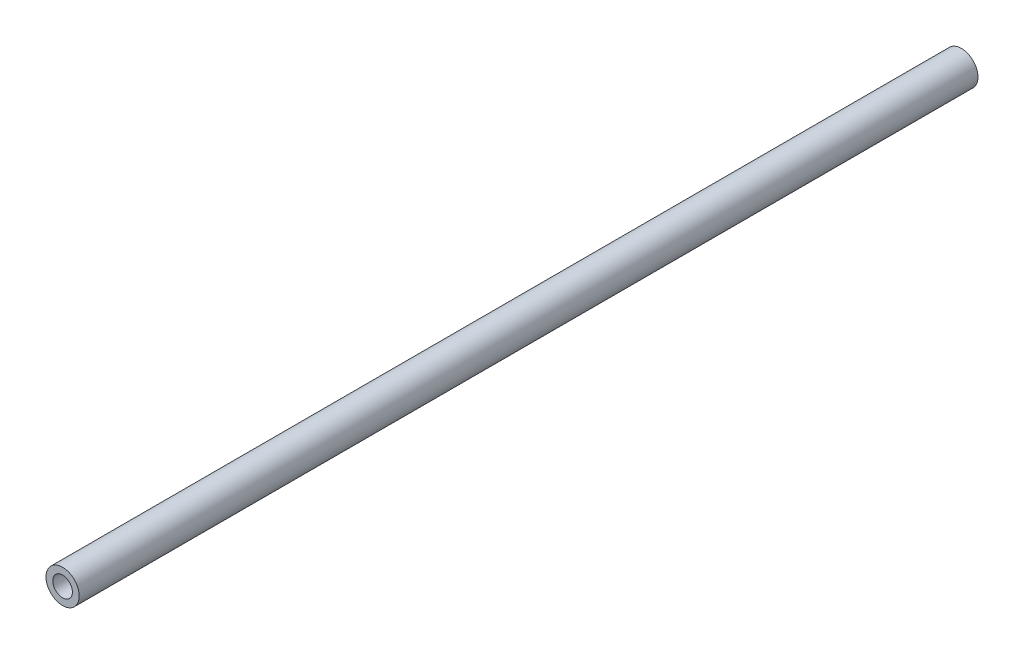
ISO-10303-21;
HEADER;
FILE_DESCRIPTION(('STEP AP214'),'2;1');
FILE_NAME('part.step','',(''),(''),'','','');
FILE_SCHEMA(('AUTOMOTIVE_DESIGN { 1 0 10303 214 1 1 1 1 }'));
ENDSEC;
DATA;
#1=APPLICATION_CONTEXT('core data for automotive mechanical design processes');
#2=APPLICATION_PROTOCOL_DEFINITION('international standard','automotive_design',2000,#1);
#3=PRODUCT_CONTEXT('',#1,'mechanical');
#4=PRODUCT('Part','Part','',(#3));
#5=PRODUCT_RELATED_PRODUCT_CATEGORY('part','',(#4));
#6=PRODUCT_DEFINITION_FORMATION('','',#4);
#7=PRODUCT_DEFINITION_CONTEXT('part definition',#1,'design');
#8=PRODUCT_DEFINITION('design','',#6,#7);
#9=PRODUCT_DEFINITION_SHAPE('','',#8);
#10=(LENGTH_UNIT() NAMED_UNIT(*) SI_UNIT(.MILLI.,.METRE.));
#11=(NAMED_UNIT(*) PLANE_ANGLE_UNIT() SI_UNIT($,.RADIAN.));
#12=(NAMED_UNIT(*) SI_UNIT($,.STERADIAN.) SOLID_ANGLE_UNIT());
#13=UNCERTAINTY_MEASURE_WITH_UNIT(LENGTH_MEASURE(1.E-05),#10,'distance_accuracy_value','');
#14=(GEOMETRIC_REPRESENTATION_CONTEXT(3) GLOBAL_UNCERTAINTY_ASSIGNED_CONTEXT((#13)) GLOBAL_UNIT_ASSIGNED_CONTEXT((#10,
#11,#12)) REPRESENTATION_CONTEXT('',''));
#15=CARTESIAN_POINT('',(0.,0.,0.));
#16=DIRECTION('',(0.,0.,1.));
#17=DIRECTION('',(1.,0.,0.));
#18=AXIS2_PLACEMENT_3D('',#15,#16,#17);
#19=CARTESIAN_POINT('',(0.,0.,-730.));
#20=DIRECTION('',(0.,0.,1.));
#21=DIRECTION('',(1.,0.,0.));
#22=AXIS2_PLACEMENT_3D('',#19,#20,#21);
#23=CYLINDRICAL_SURFACE('',#22,13.5);
#24=CARTESIAN_POINT('',(0.,0.,-730.));
#25=DIRECTION('',(0.,0.,1.));
#26=DIRECTION('',(1.,0.,0.));
#27=AXIS2_PLACEMENT_3D('',#24,#25,#26);
#28=CIRCLE('',#27,13.5);
#29=CARTESIAN_POINT('',(13.5,0.,-730.));
#30=VERTEX_POINT('',#29);
#31=EDGE_CURVE('E10',#30,#30,#28,.T.);
#32=CARTESIAN_POINT('',(0.,0.,0.));
#33=DIRECTION('',(0.,0.,1.));
#34=DIRECTION('',(1.,0.,0.));
#35=AXIS2_PLACEMENT_3D('',#32,#33,#34);
#36=CIRCLE('',#35,13.5);
#37=CARTESIAN_POINT('',(13.5,0.,-1.11022302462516E-13));
#38=VERTEX_POINT('',#37);
#39=EDGE_CURVE('E33',#38,#38,#36,.T.);
#40=CARTESIAN_POINT('',(13.5,0.,-730.));
#41=CARTESIAN_POINT('',(13.5,0.,-722.395833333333));
#42=CARTESIAN_POINT('',(13.5,0.,-714.791666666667));
#43=CARTESIAN_POINT('',(13.5,0.,-699.583333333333));
#44=CARTESIAN_POINT('',(13.5,0.,-691.979166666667));
#45=CARTESIAN_POINT('',(13.5,0.,-676.770833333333));
#46=CARTESIAN_POINT('',(13.5,0.,-669.166666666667));
#47=CARTESIAN_POINT('',(13.5,0.,-653.958333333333));
#48=CARTESIAN_POINT('',(13.5,0.,-646.354166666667));
#49=CARTESIAN_POINT('',(13.5,0.,-631.145833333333));
#50=CARTESIAN_POINT('',(13.5,0.,-623.541666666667));
#51=CARTESIAN_POINT('',(13.5,0.,-608.333333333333));
#52=CARTESIAN_POINT('',(13.5,0.,-600.729166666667));
#53=CARTESIAN_POINT('',(13.5,0.,-585.520833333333));
#54=CARTESIAN_POINT('',(13.5,0.,-577.916666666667));
#55=CARTESIAN_POINT('',(13.5,0.,-562.708333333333));
#56=CARTESIAN_POINT('',(13.5,0.,-555.104166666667));
#57=CARTESIAN_POINT('',(13.5,0.,-539.895833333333));
#58=CARTESIAN_POINT('',(13.5,0.,-532.291666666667));
#59=CARTESIAN_POINT('',(13.5,0.,-517.083333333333));
#60=CARTESIAN_POINT('',(13.5,0.,-509.479166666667));
#61=CARTESIAN_POINT('',(13.5,0.,-494.270833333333));
#62=CARTESIAN_POINT('',(13.5,0.,-486.666666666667));
#63=CARTESIAN_POINT('',(13.5,0.,-471.458333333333));
#64=CARTESIAN_POINT('',(13.5,0.,-463.854166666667));
#65=CARTESIAN_POINT('',(13.5,0.,-448.645833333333));
#66=CARTESIAN_POINT('',(13.5,0.,-441.041666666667));
#67=CARTESIAN_POINT('',(13.5,0.,-425.833333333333));
#68=CARTESIAN_POINT('',(13.5,0.,-418.229166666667));
#69=CARTESIAN_POINT('',(13.5,0.,-403.020833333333));
#70=CARTESIAN_POINT('',(13.5,0.,-395.416666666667));
#71=CARTESIAN_POINT('',(13.5,0.,-380.208333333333));
#72=CARTESIAN_POINT('',(13.5,0.,-372.604166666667));
#73=CARTESIAN_POINT('',(13.5,0.,-357.395833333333));
#74=CARTESIAN_POINT('',(13.5,0.,-349.791666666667));
#75=CARTESIAN_POINT('',(13.5,0.,-334.583333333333));
#76=CARTESIAN_POINT('',(13.5,0.,-326.979166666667));
#77=CARTESIAN_POINT('',(13.5,0.,-311.770833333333));
#78=CARTESIAN_POINT('',(13.5,0.,-304.166666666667));
#79=CARTESIAN_POINT('',(13.5,0.,-288.958333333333));
#80=CARTESIAN_POINT('',(13.5,0.,-281.354166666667));
#81=CARTESIAN_POINT('',(13.5,0.,-266.145833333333));
#82=CARTESIAN_POINT('',(13.5,0.,-258.541666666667));
#83=CARTESIAN_POINT('',(13.5,0.,-243.333333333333));
#84=CARTESIAN_POINT('',(13.5,0.,-235.729166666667));
#85=CARTESIAN_POINT('',(13.5,0.,-220.520833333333));
#86=CARTESIAN_POINT('',(13.5,0.,-212.916666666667));
#87=CARTESIAN_POINT('',(13.5,0.,-197.708333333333));
#88=CARTESIAN_POINT('',(13.5,0.,-190.104166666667));
#89=CARTESIAN_POINT('',(13.5,0.,-174.895833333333));
#90=CARTESIAN_POINT('',(13.5,0.,-167.291666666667));
#91=CARTESIAN_POINT('',(13.5,0.,-152.083333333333));
#92=CARTESIAN_POINT('',(13.5,0.,-144.479166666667));
#93=CARTESIAN_POINT('',(13.5,0.,-129.270833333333));
#94=CARTESIAN_POINT('',(13.5,0.,-121.666666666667));
#95=CARTESIAN_POINT('',(13.5,0.,-106.458333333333));
#96=CARTESIAN_POINT('',(13.5,0.,-98.8541666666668));
#97=CARTESIAN_POINT('',(13.5,0.,-83.6458333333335));
#98=CARTESIAN_POINT('',(13.5,0.,-76.0416666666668));
#99=CARTESIAN_POINT('',(13.5,0.,-60.8333333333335));
#100=CARTESIAN_POINT('',(13.5,0.,-53.2291666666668));
#101=CARTESIAN_POINT('',(13.5,0.,-38.0208333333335));
#102=CARTESIAN_POINT('',(13.5,0.,-30.4166666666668));
#103=CARTESIAN_POINT('',(13.5,0.,-15.2083333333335));
#104=CARTESIAN_POINT('',(13.5,0.,-7.60416666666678));
#105=CARTESIAN_POINT('',(13.5,0.,-1.11022302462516E-13));
#106=B_SPLINE_CURVE_WITH_KNOTS('',3,(#40,#41,#42,#43,#44,#45,#46,#47,#48,#49,#50,#51,#52,#53,
#54,#55,#56,#57,#58,#59,#60,#61,#62,#63,#64,#65,#66,#67,#68,#69,#70,#71,#72,#73,#74,#75,#76,#77,
#78,#79,#80,#81,#82,#83,#84,#85,#86,#87,#88,#89,#90,#91,#92,#93,#94,#95,#96,#97,#98,#99,#100,
#101,#102,#103,#104,#105),.UNSPECIFIED.,.F.,.F.,(4,2,2,2,2,2,2,2,2,2,2,2,2,2,2,2,2,2,2,2,2,2,2,
2,2,2,2,2,2,2,2,2,4),(0.,22.8125,45.625,68.4375,91.2500000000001,114.0625,136.875,159.6875,
182.5,205.3125,228.125,250.9375,273.75,296.5625,319.375,342.1875,365.,387.8125,410.625,433.4375,
456.25,479.0625,501.875,524.6875,547.5,570.3125,593.125,615.9375,638.75,661.5625,684.375,
707.1875,730.),.UNSPECIFIED.);
#107=EDGE_CURVE('BSEAM30',#30,#38,#106,.T.);
#108=ORIENTED_EDGE('',*,*,#31,.T.);
#109=ORIENTED_EDGE('',*,*,#39,.F.);
#110=ORIENTED_EDGE('',*,*,#107,.T.);
#111=ORIENTED_EDGE('',*,*,#107,.F.);
#112=EDGE_LOOP('',(#108,#110,#109,#111));
#113=FACE_BOUND('',#112,.T.);
#114=ADVANCED_FACE('F30',(#113),#23,.T.);
#115=CARTESIAN_POINT('',(0.,0.,-730.));
#116=DIRECTION('',(0.,0.,1.));
#117=DIRECTION('',(1.,0.,0.));
#118=AXIS2_PLACEMENT_3D('',#115,#116,#117);
#119=PLANE('',#118);
#120=CARTESIAN_POINT('',(0.,0.,-730.));
#121=DIRECTION('',(0.,0.,1.));
#122=DIRECTION('',(1.,0.,0.));
#123=AXIS2_PLACEMENT_3D('',#120,#121,#122);
#124=CIRCLE('',#123,8.);
#125=CARTESIAN_POINT('',(8.,0.,-730.));
#126=VERTEX_POINT('',#125);
#127=EDGE_CURVE('E40',#126,#126,#124,.T.);
#128=ORIENTED_EDGE('',*,*,#127,.T.);
#129=EDGE_LOOP('',(#128));
#130=FACE_BOUND('',#129,.T.);
#131=ORIENTED_EDGE('',*,*,#31,.F.);
#132=EDGE_LOOP('',(#131));
#133=FACE_BOUND('',#132,.T.);
#134=ADVANCED_FACE('F48',(#130,#133),#119,.F.);
#135=CARTESIAN_POINT('',(0.,0.,0.));
#136=DIRECTION('',(0.,0.,1.));
#137=DIRECTION('',(1.,0.,0.));
#138=AXIS2_PLACEMENT_3D('',#135,#136,#137);
#139=PLANE('',#138);
#140=CARTESIAN_POINT('',(0.,0.,0.));
#141=DIRECTION('',(0.,0.,1.));
#142=DIRECTION('',(1.,0.,0.));
#143=AXIS2_PLACEMENT_3D('',#140,#141,#142);
#144=CIRCLE('',#143,8.);
#145=CARTESIAN_POINT('',(8.,0.,-1.11022302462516E-13));
#146=VERTEX_POINT('',#145);
#147=EDGE_CURVE('E42',#146,#146,#144,.T.);
#148=ORIENTED_EDGE('',*,*,#147,.F.);
#149=EDGE_LOOP('',(#148));
#150=FACE_BOUND('',#149,.T.);
#151=ORIENTED_EDGE('',*,*,#39,.T.);
#152=EDGE_LOOP('',(#151));
#153=FACE_BOUND('',#152,.T.);
#154=ADVANCED_FACE('F54',(#150,#153),#139,.T.);
#155=CARTESIAN_POINT('',(0.,0.,-730.));
#156=DIRECTION('',(0.,0.,1.));
#157=DIRECTION('',(1.,0.,0.));
#158=AXIS2_PLACEMENT_3D('',#155,#156,#157);
#159=CYLINDRICAL_SURFACE('',#158,8.);
#160=CARTESIAN_POINT('',(8.,0.,-730.));
#161=CARTESIAN_POINT('',(8.,0.,-722.395833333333));
#162=CARTESIAN_POINT('',(8.,0.,-714.791666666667));
#163=CARTESIAN_POINT('',(8.,0.,-699.583333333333));
#164=CARTESIAN_POINT('',(8.,0.,-691.979166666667));
#165=CARTESIAN_POINT('',(8.,0.,-676.770833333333));
#166=CARTESIAN_POINT('',(8.,0.,-669.166666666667));
#167=CARTESIAN_POINT('',(8.,0.,-653.958333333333));
#168=CARTESIAN_POINT('',(8.,0.,-646.354166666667));
#169=CARTESIAN_POINT('',(8.,0.,-631.145833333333));
#170=CARTESIAN_POINT('',(8.,0.,-623.541666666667));
#171=CARTESIAN_POINT('',(8.,0.,-608.333333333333));
#172=CARTESIAN_POINT('',(8.,0.,-600.729166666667));
#173=CARTESIAN_POINT('',(8.,0.,-585.520833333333));
#174=CARTESIAN_POINT('',(8.,0.,-577.916666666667));
#175=CARTESIAN_POINT('',(8.,0.,-562.708333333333));
#176=CARTESIAN_POINT('',(8.,0.,-555.104166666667));
#177=CARTESIAN_POINT('',(8.,0.,-539.895833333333));
#178=CARTESIAN_POINT('',(8.,0.,-532.291666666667));
#179=CARTESIAN_POINT('',(8.,0.,-517.083333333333));
#180=CARTESIAN_POINT('',(8.,0.,-509.479166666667));
#181=CARTESIAN_POINT('',(8.,0.,-494.270833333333));
#182=CARTESIAN_POINT('',(8.,0.,-486.666666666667));
#183=CARTESIAN_POINT('',(8.,0.,-471.458333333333));
#184=CARTESIAN_POINT('',(8.,0.,-463.854166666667));
#185=CARTESIAN_POINT('',(8.,0.,-448.645833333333));
#186=CARTESIAN_POINT('',(8.,0.,-441.041666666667));
#187=CARTESIAN_POINT('',(8.,0.,-425.833333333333));
#188=CARTESIAN_POINT('',(8.,0.,-418.229166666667));
#189=CARTESIAN_POINT('',(8.,0.,-403.020833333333));
#190=CARTESIAN_POINT('',(8.,0.,-395.416666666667));
#191=CARTESIAN_POINT('',(8.,0.,-380.208333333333));
#192=CARTESIAN_POINT('',(8.,0.,-372.604166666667));
#193=CARTESIAN_POINT('',(8.,0.,-357.395833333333));
#194=CARTESIAN_POINT('',(8.,0.,-349.791666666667));
#195=CARTESIAN_POINT('',(8.,0.,-334.583333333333));
#196=CARTESIAN_POINT('',(8.,0.,-326.979166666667));
#197=CARTESIAN_POINT('',(8.,0.,-311.770833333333));
#198=CARTESIAN_POINT('',(8.,0.,-304.166666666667));
#199=CARTESIAN_POINT('',(8.,0.,-288.958333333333));
#200=CARTESIAN_POINT('',(8.,0.,-281.354166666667));
#201=CARTESIAN_POINT('',(8.,0.,-266.145833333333));
#202=CARTESIAN_POINT('',(8.,0.,-258.541666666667));
#203=CARTESIAN_POINT('',(8.,0.,-243.333333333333));
#204=CARTESIAN_POINT('',(8.,0.,-235.729166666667));
#205=CARTESIAN_POINT('',(8.,0.,-220.520833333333));
#206=CARTESIAN_POINT('',(8.,0.,-212.916666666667));
#207=CARTESIAN_POINT('',(8.,0.,-197.708333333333));
#208=CARTESIAN_POINT('',(8.,0.,-190.104166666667));
#209=CARTESIAN_POINT('',(8.,0.,-174.895833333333));
#210=CARTESIAN_POINT('',(8.,0.,-167.291666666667));
#211=CARTESIAN_POINT('',(8.,0.,-152.083333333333));
#212=CARTESIAN_POINT('',(8.,0.,-144.479166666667));
#213=CARTESIAN_POINT('',(8.,0.,-129.270833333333));
#214=CARTESIAN_POINT('',(8.,0.,-121.666666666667));
#215=CARTESIAN_POINT('',(8.,0.,-106.458333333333));
#216=CARTESIAN_POINT('',(8.,0.,-98.8541666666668));
#217=CARTESIAN_POINT('',(8.,0.,-83.6458333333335));
#218=CARTESIAN_POINT('',(8.,0.,-76.0416666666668));
#219=CARTESIAN_POINT('',(8.,0.,-60.8333333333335));
#220=CARTESIAN_POINT('',(8.,0.,-53.2291666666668));
#221=CARTESIAN_POINT('',(8.,0.,-38.0208333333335));
#222=CARTESIAN_POINT('',(8.,0.,-30.4166666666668));
#223=CARTESIAN_POINT('',(8.,0.,-15.2083333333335));
#224=CARTESIAN_POINT('',(8.,0.,-7.60416666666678));
#225=CARTESIAN_POINT('',(8.,0.,-1.11022302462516E-13));
#226=B_SPLINE_CURVE_WITH_KNOTS('',3,(#160,#161,#162,#163,#164,#165,#166,#167,#168,#169,#170,
#171,#172,#173,#174,#175,#176,#177,#178,#179,#180,#181,#182,#183,#184,#185,#186,#187,#188,#189,
#190,#191,#192,#193,#194,#195,#196,#197,#198,#199,#200,#201,#202,#203,#204,#205,#206,#207,#208,
#209,#210,#211,#212,#213,#214,#215,#216,#217,#218,#219,#220,#221,#222,#223,#224,#225),
.UNSPECIFIED.,.F.,.F.,(4,2,2,2,2,2,2,2,2,2,2,2,2,2,2,2,2,2,2,2,2,2,2,2,2,2,2,2,2,2,2,2,4),(0.,
22.8124999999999,45.6249999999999,68.4374999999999,91.2499999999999,114.0625,136.875,159.6875,
182.5,205.3125,228.125,250.9375,273.75,296.5625,319.375,342.1875,365.,387.8125,410.625,433.4375,
456.25,479.0625,501.875,524.6875,547.5,570.3125,593.125,615.9375,638.75,661.5625,684.375,
707.1875,730.),.UNSPECIFIED.);
#227=EDGE_CURVE('BSEAM51',#126,#146,#226,.T.);
#228=ORIENTED_EDGE('',*,*,#127,.F.);
#229=ORIENTED_EDGE('',*,*,#147,.T.);
#230=ORIENTED_EDGE('',*,*,#227,.T.);
#231=ORIENTED_EDGE('',*,*,#227,.F.);
#232=EDGE_LOOP('',(#228,#230,#229,#231));
#233=FACE_BOUND('',#232,.T.);
#234=ADVANCED_FACE('F51',(#233),#159,.F.);
#235=CLOSED_SHELL('',(#114,#134,#154,#234));
#236=MANIFOLD_SOLID_BREP('B2',#235);
#237=ADVANCED_BREP_SHAPE_REPRESENTATION('',(#18,#236),#14);
#238=SHAPE_DEFINITION_REPRESENTATION(#9,#237);
ENDSEC;
END-ISO-10303-21;
